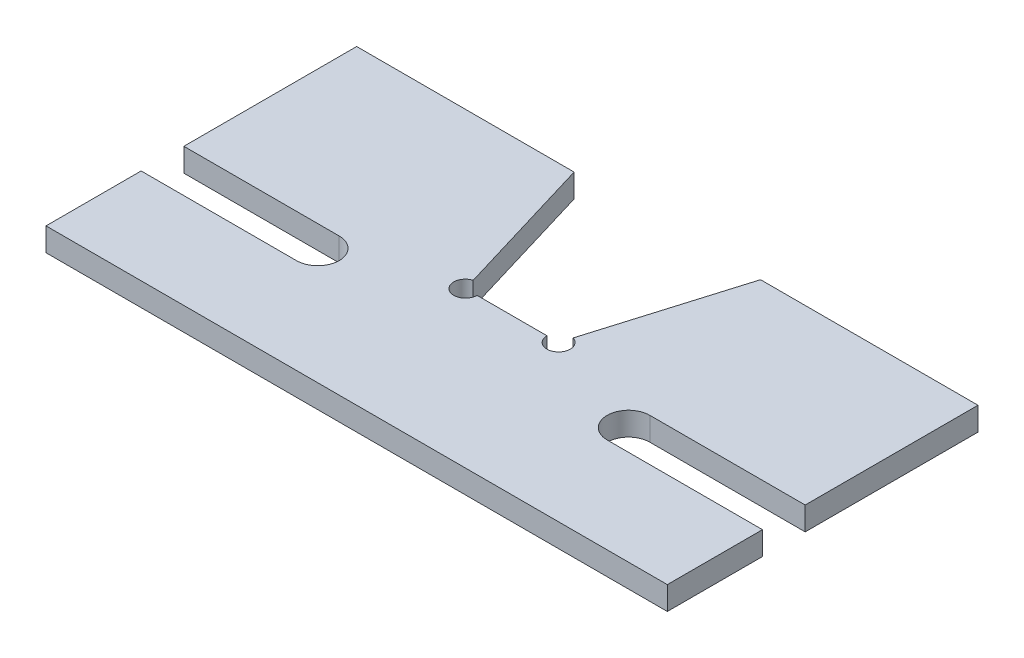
ISO-10303-21;
HEADER;
FILE_DESCRIPTION(('STEP AP214'),'2;1');
FILE_NAME('part.step','',(''),(''),'','','');
FILE_SCHEMA(('AUTOMOTIVE_DESIGN { 1 0 10303 214 1 1 1 1 }'));
ENDSEC;
DATA;
#1=APPLICATION_CONTEXT('core data for automotive mechanical design processes');
#2=APPLICATION_PROTOCOL_DEFINITION('international standard','automotive_design',2000,#1);
#3=PRODUCT_CONTEXT('',#1,'mechanical');
#4=PRODUCT('Part','Part','',(#3));
#5=PRODUCT_RELATED_PRODUCT_CATEGORY('part','',(#4));
#6=PRODUCT_DEFINITION_FORMATION('','',#4);
#7=PRODUCT_DEFINITION_CONTEXT('part definition',#1,'design');
#8=PRODUCT_DEFINITION('design','',#6,#7);
#9=PRODUCT_DEFINITION_SHAPE('','',#8);
#10=(LENGTH_UNIT() NAMED_UNIT(*) SI_UNIT(.MILLI.,.METRE.));
#11=(NAMED_UNIT(*) PLANE_ANGLE_UNIT() SI_UNIT($,.RADIAN.));
#12=(NAMED_UNIT(*) SI_UNIT($,.STERADIAN.) SOLID_ANGLE_UNIT());
#13=UNCERTAINTY_MEASURE_WITH_UNIT(LENGTH_MEASURE(1.E-05),#10,'distance_accuracy_value','');
#14=(GEOMETRIC_REPRESENTATION_CONTEXT(3) GLOBAL_UNCERTAINTY_ASSIGNED_CONTEXT((#13)) GLOBAL_UNIT_ASSIGNED_CONTEXT((#10,
#11,#12)) REPRESENTATION_CONTEXT('',''));
#15=CARTESIAN_POINT('',(0.,0.,0.));
#16=DIRECTION('',(0.,0.,1.));
#17=DIRECTION('',(1.,0.,0.));
#18=AXIS2_PLACEMENT_3D('',#15,#16,#17);
#19=CARTESIAN_POINT('',(0.,3.,0.));
#20=DIRECTION('',(1.,0.,0.));
#21=DIRECTION('',(0.,0.,-1.));
#22=AXIS2_PLACEMENT_3D('',#19,#20,#21);
#23=PLANE('',#22);
#24=DIRECTION('',(0.,0.,1.));
#25=VECTOR('',#24,1.);
#26=CARTESIAN_POINT('',(0.,0.,0.));
#27=LINE('',#26,#25);
#28=CARTESIAN_POINT('',(0.,0.,-12.25));
#29=VERTEX_POINT('',#28);
#30=CARTESIAN_POINT('',(0.,0.,0.));
#31=VERTEX_POINT('',#30);
#32=EDGE_CURVE('E187',#29,#31,#27,.T.);
#33=ORIENTED_EDGE('',*,*,#32,.T.);
#34=DIRECTION('',(0.,-1.,0.));
#35=VECTOR('',#34,1.);
#36=CARTESIAN_POINT('',(0.,3.,0.));
#37=LINE('',#36,#35);
#38=CARTESIAN_POINT('',(0.,3.,0.));
#39=VERTEX_POINT('',#38);
#40=EDGE_CURVE('E11',#39,#31,#37,.T.);
#41=ORIENTED_EDGE('',*,*,#40,.F.);
#42=DIRECTION('',(0.,0.,1.));
#43=VECTOR('',#42,1.);
#44=CARTESIAN_POINT('',(0.,3.,0.));
#45=LINE('',#44,#43);
#46=CARTESIAN_POINT('',(0.,3.,-12.25));
#47=VERTEX_POINT('',#46);
#48=EDGE_CURVE('E221',#47,#39,#45,.T.);
#49=ORIENTED_EDGE('',*,*,#48,.F.);
#50=DIRECTION('',(0.,-1.,0.));
#51=VECTOR('',#50,1.);
#52=CARTESIAN_POINT('',(0.,3.,-12.25));
#53=LINE('',#52,#51);
#54=EDGE_CURVE('E183',#47,#29,#53,.T.);
#55=ORIENTED_EDGE('',*,*,#54,.T.);
#56=EDGE_LOOP('',(#33,#41,#49,#55));
#57=FACE_BOUND('',#56,.T.);
#58=ADVANCED_FACE('F31',(#57),#23,.F.);
#59=CARTESIAN_POINT('',(0.,3.,0.));
#60=DIRECTION('',(0.,0.,-1.));
#61=DIRECTION('',(-1.,0.,0.));
#62=AXIS2_PLACEMENT_3D('',#59,#60,#61);
#63=PLANE('',#62);
#64=DIRECTION('',(1.,0.,0.));
#65=VECTOR('',#64,1.);
#66=CARTESIAN_POINT('',(0.,0.,0.));
#67=LINE('',#66,#65);
#68=CARTESIAN_POINT('',(80.,0.,0.));
#69=VERTEX_POINT('',#68);
#70=EDGE_CURVE('E190',#31,#69,#67,.T.);
#71=ORIENTED_EDGE('',*,*,#70,.T.);
#72=DIRECTION('',(0.,-1.,0.));
#73=VECTOR('',#72,1.);
#74=CARTESIAN_POINT('',(80.,3.,0.));
#75=LINE('',#74,#73);
#76=CARTESIAN_POINT('',(80.,3.,0.));
#77=VERTEX_POINT('',#76);
#78=EDGE_CURVE('E39',#77,#69,#75,.T.);
#79=ORIENTED_EDGE('',*,*,#78,.F.);
#80=DIRECTION('',(1.,0.,0.));
#81=VECTOR('',#80,1.);
#82=CARTESIAN_POINT('',(0.,3.,0.));
#83=LINE('',#82,#81);
#84=EDGE_CURVE('E120',#39,#77,#83,.T.);
#85=ORIENTED_EDGE('',*,*,#84,.F.);
#86=ORIENTED_EDGE('',*,*,#40,.T.);
#87=EDGE_LOOP('',(#71,#79,#85,#86));
#88=FACE_BOUND('',#87,.T.);
#89=ADVANCED_FACE('F329',(#88),#63,.F.);
#90=CARTESIAN_POINT('',(80.,3.,0.));
#91=DIRECTION('',(-1.,0.,0.));
#92=DIRECTION('',(0.,0.,1.));
#93=AXIS2_PLACEMENT_3D('',#90,#91,#92);
#94=PLANE('',#93);
#95=DIRECTION('',(0.,0.,-1.));
#96=VECTOR('',#95,1.);
#97=CARTESIAN_POINT('',(80.,0.,0.));
#98=LINE('',#97,#96);
#99=CARTESIAN_POINT('',(80.,0.,-12.25));
#100=VERTEX_POINT('',#99);
#101=EDGE_CURVE('E192',#69,#100,#98,.T.);
#102=ORIENTED_EDGE('',*,*,#101,.T.);
#103=DIRECTION('',(0.,-1.,0.));
#104=VECTOR('',#103,1.);
#105=CARTESIAN_POINT('',(80.,3.,-12.25));
#106=LINE('',#105,#104);
#107=CARTESIAN_POINT('',(80.,3.,-12.25));
#108=VERTEX_POINT('',#107);
#109=EDGE_CURVE('E258',#108,#100,#106,.T.);
#110=ORIENTED_EDGE('',*,*,#109,.F.);
#111=DIRECTION('',(0.,0.,-1.));
#112=VECTOR('',#111,1.);
#113=CARTESIAN_POINT('',(80.,3.,0.));
#114=LINE('',#113,#112);
#115=EDGE_CURVE('E266',#77,#108,#114,.T.);
#116=ORIENTED_EDGE('',*,*,#115,.F.);
#117=ORIENTED_EDGE('',*,*,#78,.T.);
#118=EDGE_LOOP('',(#102,#110,#116,#117));
#119=FACE_BOUND('',#118,.T.);
#120=ADVANCED_FACE('F264',(#119),#94,.F.);
#121=CARTESIAN_POINT('',(60.,3.,-12.25));
#122=DIRECTION('',(0.,0.,1.));
#123=DIRECTION('',(1.,0.,0.));
#124=AXIS2_PLACEMENT_3D('',#121,#122,#123);
#125=PLANE('',#124);
#126=DIRECTION('',(-1.,0.,0.));
#127=VECTOR('',#126,1.);
#128=CARTESIAN_POINT('',(60.,0.,-12.25));
#129=LINE('',#128,#127);
#130=CARTESIAN_POINT('',(60.,0.,-12.25));
#131=VERTEX_POINT('',#130);
#132=EDGE_CURVE('E194',#100,#131,#129,.T.);
#133=ORIENTED_EDGE('',*,*,#132,.T.);
#134=DIRECTION('',(0.,-1.,0.));
#135=VECTOR('',#134,1.);
#136=CARTESIAN_POINT('',(60.,3.,-12.25));
#137=LINE('',#136,#135);
#138=CARTESIAN_POINT('',(60.,3.,-12.25));
#139=VERTEX_POINT('',#138);
#140=EDGE_CURVE('E255',#139,#131,#137,.T.);
#141=ORIENTED_EDGE('',*,*,#140,.F.);
#142=DIRECTION('',(-1.,0.,0.));
#143=VECTOR('',#142,1.);
#144=CARTESIAN_POINT('',(60.,3.,-12.25));
#145=LINE('',#144,#143);
#146=EDGE_CURVE('E284',#108,#139,#145,.T.);
#147=ORIENTED_EDGE('',*,*,#146,.F.);
#148=ORIENTED_EDGE('',*,*,#109,.T.);
#149=EDGE_LOOP('',(#133,#141,#147,#148));
#150=FACE_BOUND('',#149,.T.);
#151=ADVANCED_FACE('F275',(#150),#125,.F.);
#152=CARTESIAN_POINT('',(60.,3.,-15.));
#153=DIRECTION('',(0.,-1.,0.));
#154=DIRECTION('',(0.,0.,-1.));
#155=AXIS2_PLACEMENT_3D('',#152,#153,#154);
#156=CYLINDRICAL_SURFACE('',#155,2.75);
#157=CARTESIAN_POINT('',(60.,0.,-15.));
#158=DIRECTION('',(0.,-1.,0.));
#159=DIRECTION('',(0.,0.,1.));
#160=AXIS2_PLACEMENT_3D('',#157,#158,#159);
#161=CIRCLE('',#160,2.75);
#162=CARTESIAN_POINT('',(60.,0.,-17.75));
#163=VERTEX_POINT('',#162);
#164=EDGE_CURVE('E196',#131,#163,#161,.T.);
#165=ORIENTED_EDGE('',*,*,#164,.T.);
#166=DIRECTION('',(0.,-1.,0.));
#167=VECTOR('',#166,1.);
#168=CARTESIAN_POINT('',(60.,3.,-17.75));
#169=LINE('',#168,#167);
#170=CARTESIAN_POINT('',(60.,3.,-17.75));
#171=VERTEX_POINT('',#170);
#172=EDGE_CURVE('E252',#171,#163,#169,.T.);
#173=ORIENTED_EDGE('',*,*,#172,.F.);
#174=CARTESIAN_POINT('',(60.,3.,-15.));
#175=DIRECTION('',(0.,-1.,0.));
#176=DIRECTION('',(0.,0.,1.));
#177=AXIS2_PLACEMENT_3D('',#174,#175,#176);
#178=CIRCLE('',#177,2.75);
#179=EDGE_CURVE('E281',#139,#171,#178,.T.);
#180=ORIENTED_EDGE('',*,*,#179,.F.);
#181=ORIENTED_EDGE('',*,*,#140,.T.);
#182=EDGE_LOOP('',(#165,#173,#180,#181));
#183=FACE_BOUND('',#182,.T.);
#184=ADVANCED_FACE('F279',(#183),#156,.F.);
#185=CARTESIAN_POINT('',(60.,3.,-17.75));
#186=DIRECTION('',(0.,0.,-1.));
#187=DIRECTION('',(-1.,0.,0.));
#188=AXIS2_PLACEMENT_3D('',#185,#186,#187);
#189=PLANE('',#188);
#190=DIRECTION('',(1.,0.,0.));
#191=VECTOR('',#190,1.);
#192=CARTESIAN_POINT('',(60.,0.,-17.75));
#193=LINE('',#192,#191);
#194=CARTESIAN_POINT('',(80.,0.,-17.75));
#195=VERTEX_POINT('',#194);
#196=EDGE_CURVE('E198',#163,#195,#193,.T.);
#197=ORIENTED_EDGE('',*,*,#196,.T.);
#198=DIRECTION('',(0.,-1.,0.));
#199=VECTOR('',#198,1.);
#200=CARTESIAN_POINT('',(80.,3.,-17.75));
#201=LINE('',#200,#199);
#202=CARTESIAN_POINT('',(80.,3.,-17.75));
#203=VERTEX_POINT('',#202);
#204=EDGE_CURVE('E249',#203,#195,#201,.T.);
#205=ORIENTED_EDGE('',*,*,#204,.F.);
#206=DIRECTION('',(1.,0.,0.));
#207=VECTOR('',#206,1.);
#208=CARTESIAN_POINT('',(60.,3.,-17.75));
#209=LINE('',#208,#207);
#210=EDGE_CURVE('E283',#171,#203,#209,.T.);
#211=ORIENTED_EDGE('',*,*,#210,.F.);
#212=ORIENTED_EDGE('',*,*,#172,.T.);
#213=EDGE_LOOP('',(#197,#205,#211,#212));
#214=FACE_BOUND('',#213,.T.);
#215=ADVANCED_FACE('F342',(#214),#189,.F.);
#216=CARTESIAN_POINT('',(80.,3.,-17.75));
#217=DIRECTION('',(-1.,0.,0.));
#218=DIRECTION('',(0.,0.,1.));
#219=AXIS2_PLACEMENT_3D('',#216,#217,#218);
#220=PLANE('',#219);
#221=DIRECTION('',(0.,0.,-1.));
#222=VECTOR('',#221,1.);
#223=CARTESIAN_POINT('',(80.,0.,-17.75));
#224=LINE('',#223,#222);
#225=CARTESIAN_POINT('',(80.,0.,-40.));
#226=VERTEX_POINT('',#225);
#227=EDGE_CURVE('E200',#195,#226,#224,.T.);
#228=ORIENTED_EDGE('',*,*,#227,.T.);
#229=DIRECTION('',(0.,-1.,0.));
#230=VECTOR('',#229,1.);
#231=CARTESIAN_POINT('',(80.,3.,-40.));
#232=LINE('',#231,#230);
#233=CARTESIAN_POINT('',(80.,3.,-40.));
#234=VERTEX_POINT('',#233);
#235=EDGE_CURVE('E246',#234,#226,#232,.T.);
#236=ORIENTED_EDGE('',*,*,#235,.F.);
#237=DIRECTION('',(0.,0.,-1.));
#238=VECTOR('',#237,1.);
#239=CARTESIAN_POINT('',(80.,3.,-17.75));
#240=LINE('',#239,#238);
#241=EDGE_CURVE('E286',#203,#234,#240,.T.);
#242=ORIENTED_EDGE('',*,*,#241,.F.);
#243=ORIENTED_EDGE('',*,*,#204,.T.);
#244=EDGE_LOOP('',(#228,#236,#242,#243));
#245=FACE_BOUND('',#244,.T.);
#246=ADVANCED_FACE('F345',(#245),#220,.F.);
#247=CARTESIAN_POINT('',(52.,3.,-40.));
#248=DIRECTION('',(0.,0.,1.));
#249=DIRECTION('',(1.,0.,0.));
#250=AXIS2_PLACEMENT_3D('',#247,#248,#249);
#251=PLANE('',#250);
#252=DIRECTION('',(-1.,0.,0.));
#253=VECTOR('',#252,1.);
#254=CARTESIAN_POINT('',(52.,0.,-40.));
#255=LINE('',#254,#253);
#256=CARTESIAN_POINT('',(52.,0.,-40.));
#257=VERTEX_POINT('',#256);
#258=EDGE_CURVE('E202',#226,#257,#255,.T.);
#259=ORIENTED_EDGE('',*,*,#258,.T.);
#260=DIRECTION('',(0.,-1.,0.));
#261=VECTOR('',#260,1.);
#262=CARTESIAN_POINT('',(52.,3.,-40.));
#263=LINE('',#262,#261);
#264=CARTESIAN_POINT('',(52.,3.,-40.));
#265=VERTEX_POINT('',#264);
#266=EDGE_CURVE('E243',#265,#257,#263,.T.);
#267=ORIENTED_EDGE('',*,*,#266,.F.);
#268=DIRECTION('',(-1.,0.,0.));
#269=VECTOR('',#268,1.);
#270=CARTESIAN_POINT('',(52.,3.,-40.));
#271=LINE('',#270,#269);
#272=EDGE_CURVE('E292',#234,#265,#271,.T.);
#273=ORIENTED_EDGE('',*,*,#272,.F.);
#274=ORIENTED_EDGE('',*,*,#235,.T.);
#275=EDGE_LOOP('',(#259,#267,#273,#274));
#276=FACE_BOUND('',#275,.T.);
#277=ADVANCED_FACE('F349',(#276),#251,.F.);
#278=CARTESIAN_POINT('',(46.4310218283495,3.,-21.4367394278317));
#279=DIRECTION('',(0.957826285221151,0.,0.287347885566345));
#280=DIRECTION('',(0.287347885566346,0.,-0.957826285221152));
#281=AXIS2_PLACEMENT_3D('',#278,#279,#280);
#282=PLANE('',#281);
#283=DIRECTION('',(-0.287347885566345,0.,0.957826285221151));
#284=VECTOR('',#283,1.);
#285=CARTESIAN_POINT('',(46.4310218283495,0.,-21.4367394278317));
#286=LINE('',#285,#284);
#287=CARTESIAN_POINT('',(46.4310218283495,0.,-21.4367394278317));
#288=VERTEX_POINT('',#287);
#289=EDGE_CURVE('E204',#257,#288,#286,.T.);
#290=ORIENTED_EDGE('',*,*,#289,.T.);
#291=DIRECTION('',(0.,-1.,0.));
#292=VECTOR('',#291,1.);
#293=CARTESIAN_POINT('',(46.4310218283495,3.,-21.4367394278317));
#294=LINE('',#293,#292);
#295=CARTESIAN_POINT('',(46.4310218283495,3.,-21.4367394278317));
#296=VERTEX_POINT('',#295);
#297=EDGE_CURVE('E240',#296,#288,#294,.T.);
#298=ORIENTED_EDGE('',*,*,#297,.F.);
#299=DIRECTION('',(-0.287347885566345,0.,0.957826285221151));
#300=VECTOR('',#299,1.);
#301=CARTESIAN_POINT('',(46.4310218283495,3.,-21.4367394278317));
#302=LINE('',#301,#300);
#303=EDGE_CURVE('E294',#265,#296,#302,.T.);
#304=ORIENTED_EDGE('',*,*,#303,.F.);
#305=ORIENTED_EDGE('',*,*,#266,.T.);
#306=EDGE_LOOP('',(#290,#298,#304,#305));
#307=FACE_BOUND('',#306,.T.);
#308=ADVANCED_FACE('F353',(#307),#282,.F.);
#309=CARTESIAN_POINT('',(46.,3.,-20.));
#310=DIRECTION('',(0.,-1.,0.));
#311=DIRECTION('',(0.,0.,-1.));
#312=AXIS2_PLACEMENT_3D('',#309,#310,#311);
#313=CYLINDRICAL_SURFACE('',#312,1.5);
#314=CARTESIAN_POINT('',(46.,0.,-20.));
#315=DIRECTION('',(0.,-1.,0.));
#316=DIRECTION('',(0.,0.,1.));
#317=AXIS2_PLACEMENT_3D('',#314,#315,#316);
#318=CIRCLE('',#317,1.5);
#319=CARTESIAN_POINT('',(44.5,0.,-20.));
#320=VERTEX_POINT('',#319);
#321=EDGE_CURVE('E206',#288,#320,#318,.T.);
#322=ORIENTED_EDGE('',*,*,#321,.T.);
#323=DIRECTION('',(0.,-1.,0.));
#324=VECTOR('',#323,1.);
#325=CARTESIAN_POINT('',(44.5,3.,-20.));
#326=LINE('',#325,#324);
#327=CARTESIAN_POINT('',(44.5,3.,-20.));
#328=VERTEX_POINT('',#327);
#329=EDGE_CURVE('E237',#328,#320,#326,.T.);
#330=ORIENTED_EDGE('',*,*,#329,.F.);
#331=CARTESIAN_POINT('',(46.,3.,-20.));
#332=DIRECTION('',(0.,-1.,0.));
#333=DIRECTION('',(0.,0.,1.));
#334=AXIS2_PLACEMENT_3D('',#331,#332,#333);
#335=CIRCLE('',#334,1.5);
#336=EDGE_CURVE('E296',#296,#328,#335,.T.);
#337=ORIENTED_EDGE('',*,*,#336,.F.);
#338=ORIENTED_EDGE('',*,*,#297,.T.);
#339=EDGE_LOOP('',(#322,#330,#337,#338));
#340=FACE_BOUND('',#339,.T.);
#341=ADVANCED_FACE('F357',(#340),#313,.F.);
#342=CARTESIAN_POINT('',(44.5,3.,-20.));
#343=DIRECTION('',(0.,0.,1.));
#344=DIRECTION('',(1.,0.,0.));
#345=AXIS2_PLACEMENT_3D('',#342,#343,#344);
#346=PLANE('',#345);
#347=DIRECTION('',(-1.,0.,0.));
#348=VECTOR('',#347,1.);
#349=CARTESIAN_POINT('',(44.5,0.,-20.));
#350=LINE('',#349,#348);
#351=CARTESIAN_POINT('',(35.5,0.,-20.));
#352=VERTEX_POINT('',#351);
#353=EDGE_CURVE('E208',#320,#352,#350,.T.);
#354=ORIENTED_EDGE('',*,*,#353,.T.);
#355=DIRECTION('',(0.,-1.,0.));
#356=VECTOR('',#355,1.);
#357=CARTESIAN_POINT('',(35.5,3.,-20.));
#358=LINE('',#357,#356);
#359=CARTESIAN_POINT('',(35.5,3.,-20.));
#360=VERTEX_POINT('',#359);
#361=EDGE_CURVE('E234',#360,#352,#358,.T.);
#362=ORIENTED_EDGE('',*,*,#361,.F.);
#363=DIRECTION('',(-1.,0.,0.));
#364=VECTOR('',#363,1.);
#365=CARTESIAN_POINT('',(44.5,3.,-20.));
#366=LINE('',#365,#364);
#367=EDGE_CURVE('E298',#328,#360,#366,.T.);
#368=ORIENTED_EDGE('',*,*,#367,.F.);
#369=ORIENTED_EDGE('',*,*,#329,.T.);
#370=EDGE_LOOP('',(#354,#362,#368,#369));
#371=FACE_BOUND('',#370,.T.);
#372=ADVANCED_FACE('F361',(#371),#346,.F.);
#373=CARTESIAN_POINT('',(34.,3.,-20.));
#374=DIRECTION('',(0.,-1.,0.));
#375=DIRECTION('',(0.,0.,-1.));
#376=AXIS2_PLACEMENT_3D('',#373,#374,#375);
#377=CYLINDRICAL_SURFACE('',#376,1.5);
#378=CARTESIAN_POINT('',(34.,0.,-20.));
#379=DIRECTION('',(0.,-1.,0.));
#380=DIRECTION('',(0.,0.,1.));
#381=AXIS2_PLACEMENT_3D('',#378,#379,#380);
#382=CIRCLE('',#381,1.5);
#383=CARTESIAN_POINT('',(33.5689781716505,0.,-21.4367394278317));
#384=VERTEX_POINT('',#383);
#385=EDGE_CURVE('E210',#352,#384,#382,.T.);
#386=ORIENTED_EDGE('',*,*,#385,.T.);
#387=DIRECTION('',(0.,-1.,0.));
#388=VECTOR('',#387,1.);
#389=CARTESIAN_POINT('',(33.5689781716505,3.,-21.4367394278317));
#390=LINE('',#389,#388);
#391=CARTESIAN_POINT('',(33.5689781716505,3.,-21.4367394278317));
#392=VERTEX_POINT('',#391);
#393=EDGE_CURVE('E231',#392,#384,#390,.T.);
#394=ORIENTED_EDGE('',*,*,#393,.F.);
#395=CARTESIAN_POINT('',(34.,3.,-20.));
#396=DIRECTION('',(0.,-1.,0.));
#397=DIRECTION('',(0.,0.,1.));
#398=AXIS2_PLACEMENT_3D('',#395,#396,#397);
#399=CIRCLE('',#398,1.5);
#400=EDGE_CURVE('E300',#360,#392,#399,.T.);
#401=ORIENTED_EDGE('',*,*,#400,.F.);
#402=ORIENTED_EDGE('',*,*,#361,.T.);
#403=EDGE_LOOP('',(#386,#394,#401,#402));
#404=FACE_BOUND('',#403,.T.);
#405=ADVANCED_FACE('F365',(#404),#377,.F.);
#406=CARTESIAN_POINT('',(33.5689781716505,3.,-21.4367394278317));
#407=DIRECTION('',(-0.957826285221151,0.,0.287347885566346));
#408=DIRECTION('',(0.287347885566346,0.,0.957826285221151));
#409=AXIS2_PLACEMENT_3D('',#406,#407,#408);
#410=PLANE('',#409);
#411=DIRECTION('',(-0.287347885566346,0.,-0.957826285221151));
#412=VECTOR('',#411,1.);
#413=CARTESIAN_POINT('',(33.5689781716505,0.,-21.4367394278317));
#414=LINE('',#413,#412);
#415=CARTESIAN_POINT('',(28.,0.,-40.));
#416=VERTEX_POINT('',#415);
#417=EDGE_CURVE('E212',#384,#416,#414,.T.);
#418=ORIENTED_EDGE('',*,*,#417,.T.);
#419=DIRECTION('',(0.,-1.,0.));
#420=VECTOR('',#419,1.);
#421=CARTESIAN_POINT('',(28.,3.,-40.));
#422=LINE('',#421,#420);
#423=CARTESIAN_POINT('',(28.,3.,-40.));
#424=VERTEX_POINT('',#423);
#425=EDGE_CURVE('E228',#424,#416,#422,.T.);
#426=ORIENTED_EDGE('',*,*,#425,.F.);
#427=DIRECTION('',(-0.287347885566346,0.,-0.957826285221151));
#428=VECTOR('',#427,1.);
#429=CARTESIAN_POINT('',(33.5689781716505,3.,-21.4367394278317));
#430=LINE('',#429,#428);
#431=EDGE_CURVE('E302',#392,#424,#430,.T.);
#432=ORIENTED_EDGE('',*,*,#431,.F.);
#433=ORIENTED_EDGE('',*,*,#393,.T.);
#434=EDGE_LOOP('',(#418,#426,#432,#433));
#435=FACE_BOUND('',#434,.T.);
#436=ADVANCED_FACE('F369',(#435),#410,.F.);
#437=CARTESIAN_POINT('',(0.,3.,-40.));
#438=DIRECTION('',(0.,0.,1.));
#439=DIRECTION('',(1.,0.,0.));
#440=AXIS2_PLACEMENT_3D('',#437,#438,#439);
#441=PLANE('',#440);
#442=DIRECTION('',(-1.,0.,0.));
#443=VECTOR('',#442,1.);
#444=CARTESIAN_POINT('',(0.,0.,-40.));
#445=LINE('',#444,#443);
#446=CARTESIAN_POINT('',(0.,0.,-40.));
#447=VERTEX_POINT('',#446);
#448=EDGE_CURVE('E214',#416,#447,#445,.T.);
#449=ORIENTED_EDGE('',*,*,#448,.T.);
#450=DIRECTION('',(0.,-1.,0.));
#451=VECTOR('',#450,1.);
#452=CARTESIAN_POINT('',(0.,3.,-40.));
#453=LINE('',#452,#451);
#454=CARTESIAN_POINT('',(0.,3.,-40.));
#455=VERTEX_POINT('',#454);
#456=EDGE_CURVE('E225',#455,#447,#453,.T.);
#457=ORIENTED_EDGE('',*,*,#456,.F.);
#458=DIRECTION('',(-1.,0.,0.));
#459=VECTOR('',#458,1.);
#460=CARTESIAN_POINT('',(0.,3.,-40.));
#461=LINE('',#460,#459);
#462=EDGE_CURVE('E304',#424,#455,#461,.T.);
#463=ORIENTED_EDGE('',*,*,#462,.F.);
#464=ORIENTED_EDGE('',*,*,#425,.T.);
#465=EDGE_LOOP('',(#449,#457,#463,#464));
#466=FACE_BOUND('',#465,.T.);
#467=ADVANCED_FACE('F310',(#466),#441,.F.);
#468=CARTESIAN_POINT('',(0.,3.,-17.75));
#469=DIRECTION('',(1.,0.,0.));
#470=DIRECTION('',(0.,0.,-1.));
#471=AXIS2_PLACEMENT_3D('',#468,#469,#470);
#472=PLANE('',#471);
#473=DIRECTION('',(0.,0.,1.));
#474=VECTOR('',#473,1.);
#475=CARTESIAN_POINT('',(0.,0.,-17.75));
#476=LINE('',#475,#474);
#477=CARTESIAN_POINT('',(0.,0.,-17.75));
#478=VERTEX_POINT('',#477);
#479=EDGE_CURVE('E216',#447,#478,#476,.T.);
#480=ORIENTED_EDGE('',*,*,#479,.T.);
#481=DIRECTION('',(0.,-1.,0.));
#482=VECTOR('',#481,1.);
#483=CARTESIAN_POINT('',(0.,3.,-17.75));
#484=LINE('',#483,#482);
#485=CARTESIAN_POINT('',(0.,3.,-17.75));
#486=VERTEX_POINT('',#485);
#487=EDGE_CURVE('E178',#486,#478,#484,.T.);
#488=ORIENTED_EDGE('',*,*,#487,.F.);
#489=DIRECTION('',(0.,0.,1.));
#490=VECTOR('',#489,1.);
#491=CARTESIAN_POINT('',(0.,3.,-17.75));
#492=LINE('',#491,#490);
#493=EDGE_CURVE('E169',#455,#486,#492,.T.);
#494=ORIENTED_EDGE('',*,*,#493,.F.);
#495=ORIENTED_EDGE('',*,*,#456,.T.);
#496=EDGE_LOOP('',(#480,#488,#494,#495));
#497=FACE_BOUND('',#496,.T.);
#498=ADVANCED_FACE('F314',(#497),#472,.F.);
#499=CARTESIAN_POINT('',(20.,3.,-17.75));
#500=DIRECTION('',(0.,0.,-1.));
#501=DIRECTION('',(-1.,0.,0.));
#502=AXIS2_PLACEMENT_3D('',#499,#500,#501);
#503=PLANE('',#502);
#504=DIRECTION('',(1.,0.,0.));
#505=VECTOR('',#504,1.);
#506=CARTESIAN_POINT('',(20.,0.,-17.75));
#507=LINE('',#506,#505);
#508=CARTESIAN_POINT('',(20.,0.,-17.75));
#509=VERTEX_POINT('',#508);
#510=EDGE_CURVE('E177',#478,#509,#507,.T.);
#511=ORIENTED_EDGE('',*,*,#510,.T.);
#512=DIRECTION('',(0.,-1.,0.));
#513=VECTOR('',#512,1.);
#514=CARTESIAN_POINT('',(20.,3.,-17.75));
#515=LINE('',#514,#513);
#516=CARTESIAN_POINT('',(20.,3.,-17.75));
#517=VERTEX_POINT('',#516);
#518=EDGE_CURVE('E174',#517,#509,#515,.T.);
#519=ORIENTED_EDGE('',*,*,#518,.F.);
#520=DIRECTION('',(1.,0.,0.));
#521=VECTOR('',#520,1.);
#522=CARTESIAN_POINT('',(20.,3.,-17.75));
#523=LINE('',#522,#521);
#524=EDGE_CURVE('E163',#486,#517,#523,.T.);
#525=ORIENTED_EDGE('',*,*,#524,.F.);
#526=ORIENTED_EDGE('',*,*,#487,.T.);
#527=EDGE_LOOP('',(#511,#519,#525,#526));
#528=FACE_BOUND('',#527,.T.);
#529=ADVANCED_FACE('F175',(#528),#503,.F.);
#530=CARTESIAN_POINT('',(20.,3.,-15.));
#531=DIRECTION('',(0.,-1.,0.));
#532=DIRECTION('',(0.,0.,-1.));
#533=AXIS2_PLACEMENT_3D('',#530,#531,#532);
#534=CYLINDRICAL_SURFACE('',#533,2.75);
#535=CARTESIAN_POINT('',(20.,0.,-15.));
#536=DIRECTION('',(0.,-1.,0.));
#537=DIRECTION('',(0.,0.,1.));
#538=AXIS2_PLACEMENT_3D('',#535,#536,#537);
#539=CIRCLE('',#538,2.75);
#540=CARTESIAN_POINT('',(20.,0.,-12.25));
#541=VERTEX_POINT('',#540);
#542=EDGE_CURVE('E106',#509,#541,#539,.T.);
#543=ORIENTED_EDGE('',*,*,#542,.T.);
#544=DIRECTION('',(0.,-1.,0.));
#545=VECTOR('',#544,1.);
#546=CARTESIAN_POINT('',(20.,3.,-12.25));
#547=LINE('',#546,#545);
#548=CARTESIAN_POINT('',(20.,3.,-12.25));
#549=VERTEX_POINT('',#548);
#550=EDGE_CURVE('E179',#549,#541,#547,.T.);
#551=ORIENTED_EDGE('',*,*,#550,.F.);
#552=CARTESIAN_POINT('',(20.,3.,-15.));
#553=DIRECTION('',(0.,-1.,0.));
#554=DIRECTION('',(0.,0.,1.));
#555=AXIS2_PLACEMENT_3D('',#552,#553,#554);
#556=CIRCLE('',#555,2.75);
#557=EDGE_CURVE('E167',#517,#549,#556,.T.);
#558=ORIENTED_EDGE('',*,*,#557,.F.);
#559=ORIENTED_EDGE('',*,*,#518,.T.);
#560=EDGE_LOOP('',(#543,#551,#558,#559));
#561=FACE_BOUND('',#560,.T.);
#562=ADVANCED_FACE('F181',(#561),#534,.F.);
#563=CARTESIAN_POINT('',(20.,3.,-12.25));
#564=DIRECTION('',(0.,0.,1.));
#565=DIRECTION('',(1.,0.,0.));
#566=AXIS2_PLACEMENT_3D('',#563,#564,#565);
#567=PLANE('',#566);
#568=DIRECTION('',(-1.,0.,0.));
#569=VECTOR('',#568,1.);
#570=CARTESIAN_POINT('',(20.,0.,-12.25));
#571=LINE('',#570,#569);
#572=EDGE_CURVE('E112',#541,#29,#571,.T.);
#573=ORIENTED_EDGE('',*,*,#572,.T.);
#574=ORIENTED_EDGE('',*,*,#54,.F.);
#575=DIRECTION('',(-1.,0.,0.));
#576=VECTOR('',#575,1.);
#577=CARTESIAN_POINT('',(20.,3.,-12.25));
#578=LINE('',#577,#576);
#579=EDGE_CURVE('E47',#549,#47,#578,.T.);
#580=ORIENTED_EDGE('',*,*,#579,.F.);
#581=ORIENTED_EDGE('',*,*,#550,.T.);
#582=EDGE_LOOP('',(#573,#574,#580,#581));
#583=FACE_BOUND('',#582,.T.);
#584=ADVANCED_FACE('F318',(#583),#567,.F.);
#585=CARTESIAN_POINT('',(20.,3.,-15.));
#586=DIRECTION('',(0.,1.,0.));
#587=DIRECTION('',(0.,0.,1.));
#588=AXIS2_PLACEMENT_3D('',#585,#586,#587);
#589=PLANE('',#588);
#590=ORIENTED_EDGE('',*,*,#48,.T.);
#591=ORIENTED_EDGE('',*,*,#84,.T.);
#592=ORIENTED_EDGE('',*,*,#115,.T.);
#593=ORIENTED_EDGE('',*,*,#146,.T.);
#594=ORIENTED_EDGE('',*,*,#179,.T.);
#595=ORIENTED_EDGE('',*,*,#210,.T.);
#596=ORIENTED_EDGE('',*,*,#241,.T.);
#597=ORIENTED_EDGE('',*,*,#272,.T.);
#598=ORIENTED_EDGE('',*,*,#303,.T.);
#599=ORIENTED_EDGE('',*,*,#336,.T.);
#600=ORIENTED_EDGE('',*,*,#367,.T.);
#601=ORIENTED_EDGE('',*,*,#400,.T.);
#602=ORIENTED_EDGE('',*,*,#431,.T.);
#603=ORIENTED_EDGE('',*,*,#462,.T.);
#604=ORIENTED_EDGE('',*,*,#493,.T.);
#605=ORIENTED_EDGE('',*,*,#524,.T.);
#606=ORIENTED_EDGE('',*,*,#557,.T.);
#607=ORIENTED_EDGE('',*,*,#579,.T.);
#608=EDGE_LOOP('',(#590,#591,#592,#593,#594,#595,#596,#597,#598,#599,#600,#601,#602,#603,#604,
#605,#606,#607));
#609=FACE_BOUND('',#608,.T.);
#610=ADVANCED_FACE('F165',(#609),#589,.T.);
#611=CARTESIAN_POINT('',(20.,0.,-15.));
#612=DIRECTION('',(0.,1.,0.));
#613=DIRECTION('',(0.,0.,1.));
#614=AXIS2_PLACEMENT_3D('',#611,#612,#613);
#615=PLANE('',#614);
#616=ORIENTED_EDGE('',*,*,#32,.F.);
#617=ORIENTED_EDGE('',*,*,#572,.F.);
#618=ORIENTED_EDGE('',*,*,#542,.F.);
#619=ORIENTED_EDGE('',*,*,#510,.F.);
#620=ORIENTED_EDGE('',*,*,#479,.F.);
#621=ORIENTED_EDGE('',*,*,#448,.F.);
#622=ORIENTED_EDGE('',*,*,#417,.F.);
#623=ORIENTED_EDGE('',*,*,#385,.F.);
#624=ORIENTED_EDGE('',*,*,#353,.F.);
#625=ORIENTED_EDGE('',*,*,#321,.F.);
#626=ORIENTED_EDGE('',*,*,#289,.F.);
#627=ORIENTED_EDGE('',*,*,#258,.F.);
#628=ORIENTED_EDGE('',*,*,#227,.F.);
#629=ORIENTED_EDGE('',*,*,#196,.F.);
#630=ORIENTED_EDGE('',*,*,#164,.F.);
#631=ORIENTED_EDGE('',*,*,#132,.F.);
#632=ORIENTED_EDGE('',*,*,#101,.F.);
#633=ORIENTED_EDGE('',*,*,#70,.F.);
#634=EDGE_LOOP('',(#616,#617,#618,#619,#620,#621,#622,#623,#624,#625,#626,#627,#628,#629,#630,
#631,#632,#633));
#635=FACE_BOUND('',#634,.T.);
#636=ADVANCED_FACE('F270',(#635),#615,.F.);
#637=CLOSED_SHELL('',(#58,#89,#120,#151,#184,#215,#246,#277,#308,#341,#372,#405,#436,#467,#498,
#529,#562,#584,#610,#636));
#638=MANIFOLD_SOLID_BREP('B2',#637);
#639=ADVANCED_BREP_SHAPE_REPRESENTATION('',(#18,#638),#14);
#640=SHAPE_DEFINITION_REPRESENTATION(#9,#639);
ENDSEC;
END-ISO-10303-21;
